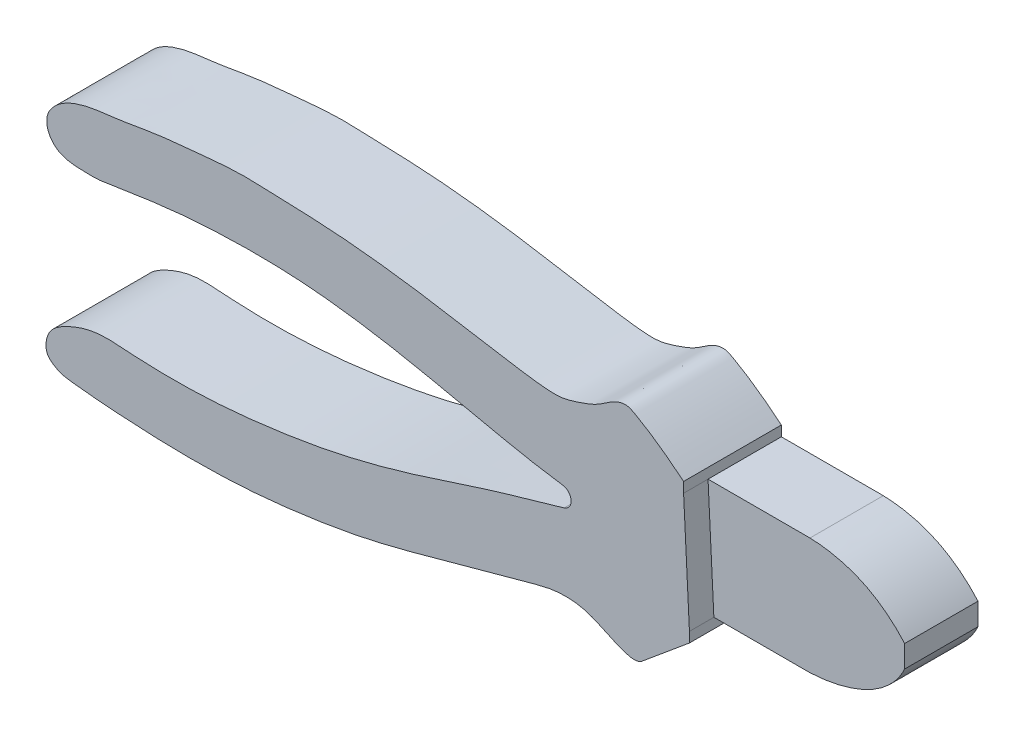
ISO-10303-21;
HEADER;
FILE_DESCRIPTION(('STEP AP214'),'2;1');
FILE_NAME('part.step','',(''),(''),'','','');
FILE_SCHEMA(('AUTOMOTIVE_DESIGN { 1 0 10303 214 1 1 1 1 }'));
ENDSEC;
DATA;
#1=APPLICATION_CONTEXT('core data for automotive mechanical design processes');
#2=APPLICATION_PROTOCOL_DEFINITION('international standard','automotive_design',2000,#1);
#3=PRODUCT_CONTEXT('',#1,'mechanical');
#4=PRODUCT('Part','Part','',(#3));
#5=PRODUCT_RELATED_PRODUCT_CATEGORY('part','',(#4));
#6=PRODUCT_DEFINITION_FORMATION('','',#4);
#7=PRODUCT_DEFINITION_CONTEXT('part definition',#1,'design');
#8=PRODUCT_DEFINITION('design','',#6,#7);
#9=PRODUCT_DEFINITION_SHAPE('','',#8);
#10=(LENGTH_UNIT() NAMED_UNIT(*) SI_UNIT(.MILLI.,.METRE.));
#11=(NAMED_UNIT(*) PLANE_ANGLE_UNIT() SI_UNIT($,.RADIAN.));
#12=(NAMED_UNIT(*) SI_UNIT($,.STERADIAN.) SOLID_ANGLE_UNIT());
#13=UNCERTAINTY_MEASURE_WITH_UNIT(LENGTH_MEASURE(1.E-05),#10,'distance_accuracy_value','');
#14=(GEOMETRIC_REPRESENTATION_CONTEXT(3) GLOBAL_UNCERTAINTY_ASSIGNED_CONTEXT((#13)) GLOBAL_UNIT_ASSIGNED_CONTEXT((#10,
#11,#12)) REPRESENTATION_CONTEXT('',''));
#15=CARTESIAN_POINT('',(0.,0.,0.));
#16=DIRECTION('',(0.,0.,1.));
#17=DIRECTION('',(1.,0.,0.));
#18=AXIS2_PLACEMENT_3D('',#15,#16,#17);
#19=CARTESIAN_POINT('',(2.59423328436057,48.3108363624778,-10.));
#20=CARTESIAN_POINT('',(1.47646928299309,46.2620053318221,-10.));
#21=CARTESIAN_POINT('',(2.66051111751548,42.8560888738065,-10.));
#22=CARTESIAN_POINT('',(6.5858538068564,41.3022828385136,-10.));
#23=CARTESIAN_POINT('',(9.56225288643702,41.2352917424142,-10.));
#24=CARTESIAN_POINT('',(12.3760863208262,41.1368955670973,-10.));
#25=CARTESIAN_POINT('',(17.9784928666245,42.0328737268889,-10.));
#26=CARTESIAN_POINT('',(27.1865835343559,43.4763817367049,-10.));
#27=CARTESIAN_POINT('',(40.8679135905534,44.3804355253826,-10.));
#28=CARTESIAN_POINT('',(56.9925215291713,44.0656132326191,-10.));
#29=CARTESIAN_POINT('',(75.780755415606,41.245410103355,-10.));
#30=CARTESIAN_POINT('',(92.9534435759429,37.1633292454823,-10.));
#31=CARTESIAN_POINT('',(103.971043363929,35.0986701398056,-10.));
#32=CARTESIAN_POINT('',(107.630187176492,34.6050114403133,-10.));
#33=B_SPLINE_CURVE_WITH_KNOTS('',3,(#19,#20,#21,#22,#23,#24,#25,#26,#27,#28,#29,#30,#31,#32),
.UNSPECIFIED.,.F.,.F.,(4,1,1,1,1,1,1,1,1,1,1,4),(0.173029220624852,0.220476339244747,
0.237410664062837,0.264634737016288,0.286507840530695,0.300105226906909,0.391007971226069,
0.494697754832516,0.605638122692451,0.750424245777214,0.917570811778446,1.),.UNSPECIFIED.);
#34=DIRECTION('',(0.,0.,1.));
#35=VECTOR('',#34,1.);
#36=SURFACE_OF_LINEAR_EXTRUSION('',#33,#35);
#37=DIRECTION('',(0.,0.,1.));
#38=VECTOR('',#37,1.);
#39=CARTESIAN_POINT('',(107.630187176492,34.6050114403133,-10.));
#40=LINE('',#39,#38);
#41=CARTESIAN_POINT('',(107.630187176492,34.6050114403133,-10.));
#42=VERTEX_POINT('',#41);
#43=CARTESIAN_POINT('',(107.630187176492,34.6050114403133,10.));
#44=VERTEX_POINT('',#43);
#45=EDGE_CURVE('E191',#42,#44,#40,.T.);
#46=ORIENTED_EDGE('',*,*,#45,.T.);
#47=CARTESIAN_POINT('',(2.59423328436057,48.3108363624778,10.));
#48=CARTESIAN_POINT('',(1.47646928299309,46.2620053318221,10.));
#49=CARTESIAN_POINT('',(2.66051111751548,42.8560888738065,10.));
#50=CARTESIAN_POINT('',(6.5858538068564,41.3022828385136,10.));
#51=CARTESIAN_POINT('',(9.56225288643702,41.2352917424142,10.));
#52=CARTESIAN_POINT('',(12.3760863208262,41.1368955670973,10.));
#53=CARTESIAN_POINT('',(17.9784928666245,42.0328737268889,10.));
#54=CARTESIAN_POINT('',(27.1865835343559,43.4763817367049,10.));
#55=CARTESIAN_POINT('',(40.8679135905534,44.3804355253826,10.));
#56=CARTESIAN_POINT('',(56.9925215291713,44.0656132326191,10.));
#57=CARTESIAN_POINT('',(75.780755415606,41.245410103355,10.));
#58=CARTESIAN_POINT('',(92.9534435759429,37.1633292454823,10.));
#59=CARTESIAN_POINT('',(103.971043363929,35.0986701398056,10.));
#60=CARTESIAN_POINT('',(107.630187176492,34.6050114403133,10.));
#61=B_SPLINE_CURVE_WITH_KNOTS('',3,(#47,#48,#49,#50,#51,#52,#53,#54,#55,#56,#57,#58,#59,#60),
.UNSPECIFIED.,.F.,.F.,(4,1,1,1,1,1,1,1,1,1,1,4),(0.173029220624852,0.220476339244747,
0.237410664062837,0.264634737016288,0.286507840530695,0.300105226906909,0.391007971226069,
0.494697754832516,0.605638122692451,0.750424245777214,0.917570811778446,1.),.UNSPECIFIED.);
#62=CARTESIAN_POINT('',(2.59423328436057,48.3108363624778,10.));
#63=VERTEX_POINT('',#62);
#64=EDGE_CURVE('E253',#63,#44,#61,.T.);
#65=ORIENTED_EDGE('',*,*,#64,.F.);
#66=DIRECTION('',(0.,0.,1.));
#67=VECTOR('',#66,1.);
#68=CARTESIAN_POINT('',(2.59423328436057,48.3108363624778,-10.));
#69=LINE('',#68,#67);
#70=CARTESIAN_POINT('',(2.59423328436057,48.3108363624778,-10.));
#71=VERTEX_POINT('',#70);
#72=EDGE_CURVE('E11',#71,#63,#69,.T.);
#73=ORIENTED_EDGE('',*,*,#72,.F.);
#74=EDGE_CURVE('E294',#71,#42,#33,.T.);
#75=ORIENTED_EDGE('',*,*,#74,.T.);
#76=EDGE_LOOP('',(#46,#65,#73,#75));
#77=FACE_BOUND('',#76,.T.);
#78=ADVANCED_FACE('F39',(#77),#36,.T.);
#79=CARTESIAN_POINT('',(132.369670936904,47.6205061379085,-10.));
#80=CARTESIAN_POINT('',(128.995611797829,50.3860055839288,-10.));
#81=CARTESIAN_POINT('',(125.642014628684,52.8778427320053,-10.));
#82=CARTESIAN_POINT('',(120.976889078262,55.3938767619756,-10.));
#83=CARTESIAN_POINT('',(119.218269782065,55.1580822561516,-10.));
#84=CARTESIAN_POINT('',(117.137784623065,54.1487715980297,-10.));
#85=CARTESIAN_POINT('',(114.725193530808,52.2265677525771,-10.));
#86=CARTESIAN_POINT('',(111.076725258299,50.9475573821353,-10.));
#87=CARTESIAN_POINT('',(107.483571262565,49.7932053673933,-10.));
#88=CARTESIAN_POINT('',(103.17865934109,50.021589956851,-10.));
#89=CARTESIAN_POINT('',(97.354781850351,50.8871071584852,-10.));
#90=CARTESIAN_POINT('',(88.8389636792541,52.2998702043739,-10.));
#91=CARTESIAN_POINT('',(79.0048645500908,54.0071144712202,-10.));
#92=CARTESIAN_POINT('',(67.9767815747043,55.4653615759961,-10.));
#93=CARTESIAN_POINT('',(57.9908738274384,56.3120323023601,-10.));
#94=CARTESIAN_POINT('',(49.2714015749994,56.4996536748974,-10.));
#95=CARTESIAN_POINT('',(40.7839541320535,56.9741615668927,-10.));
#96=CARTESIAN_POINT('',(32.6858319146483,56.0256149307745,-10.));
#97=CARTESIAN_POINT('',(24.1318491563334,55.272111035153,-10.));
#98=CARTESIAN_POINT('',(16.6381859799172,53.7468103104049,-10.));
#99=CARTESIAN_POINT('',(8.81025843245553,53.2542794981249,-10.));
#100=CARTESIAN_POINT('',(3.872862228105,50.4982255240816,-10.));
#101=CARTESIAN_POINT('',(2.59423328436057,48.3108363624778,-10.));
#102=B_SPLINE_CURVE_WITH_KNOTS('',3,(#79,#80,#81,#82,#83,#84,#85,#86,#87,#88,#89,#90,#91,#92,
#93,#94,#95,#96,#97,#98,#99,#100,#101),.UNSPECIFIED.,.F.,.F.,(4,1,1,1,1,1,1,1,1,1,1,1,1,1,1,1,1,
1,1,1,4),(0.,0.0894459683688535,0.101433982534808,0.114075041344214,0.126744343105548,
0.152595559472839,0.181536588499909,0.21179973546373,0.23523853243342,0.275985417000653,
0.34251625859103,0.426256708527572,0.497072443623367,0.588829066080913,0.647993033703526,
0.690272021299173,0.776828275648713,0.827938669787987,0.880355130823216,0.946145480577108,1.),.UNSPECIFIED.);
#103=DIRECTION('',(0.,0.,1.));
#104=VECTOR('',#103,1.);
#105=SURFACE_OF_LINEAR_EXTRUSION('',#102,#104);
#106=ORIENTED_EDGE('',*,*,#72,.T.);
#107=CARTESIAN_POINT('',(132.369670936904,47.6205061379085,10.));
#108=CARTESIAN_POINT('',(128.995611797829,50.3860055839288,10.));
#109=CARTESIAN_POINT('',(125.642014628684,52.8778427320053,10.));
#110=CARTESIAN_POINT('',(120.976889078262,55.3938767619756,10.));
#111=CARTESIAN_POINT('',(119.218269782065,55.1580822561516,10.));
#112=CARTESIAN_POINT('',(117.137784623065,54.1487715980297,10.));
#113=CARTESIAN_POINT('',(114.725193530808,52.2265677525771,10.));
#114=CARTESIAN_POINT('',(111.076725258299,50.9475573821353,10.));
#115=CARTESIAN_POINT('',(107.483571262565,49.7932053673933,10.));
#116=CARTESIAN_POINT('',(103.17865934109,50.021589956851,10.));
#117=CARTESIAN_POINT('',(97.354781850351,50.8871071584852,10.));
#118=CARTESIAN_POINT('',(88.8389636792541,52.2998702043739,10.));
#119=CARTESIAN_POINT('',(79.0048645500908,54.0071144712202,10.));
#120=CARTESIAN_POINT('',(67.9767815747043,55.4653615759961,10.));
#121=CARTESIAN_POINT('',(57.9908738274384,56.3120323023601,10.));
#122=CARTESIAN_POINT('',(49.2714015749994,56.4996536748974,10.));
#123=CARTESIAN_POINT('',(40.7839541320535,56.9741615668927,10.));
#124=CARTESIAN_POINT('',(32.6858319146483,56.0256149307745,10.));
#125=CARTESIAN_POINT('',(24.1318491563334,55.272111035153,10.));
#126=CARTESIAN_POINT('',(16.6381859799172,53.7468103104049,10.));
#127=CARTESIAN_POINT('',(8.81025843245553,53.2542794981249,10.));
#128=CARTESIAN_POINT('',(3.872862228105,50.4982255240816,10.));
#129=CARTESIAN_POINT('',(2.59423328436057,48.3108363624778,10.));
#130=B_SPLINE_CURVE_WITH_KNOTS('',3,(#107,#108,#109,#110,#111,#112,#113,#114,#115,#116,#117,
#118,#119,#120,#121,#122,#123,#124,#125,#126,#127,#128,#129),.UNSPECIFIED.,.F.,.F.,(4,1,1,1,1,1,
1,1,1,1,1,1,1,1,1,1,1,1,1,1,4),(0.,0.0894459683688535,0.101433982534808,0.114075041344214,
0.126744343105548,0.152595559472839,0.181536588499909,0.21179973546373,0.23523853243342,
0.275985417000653,0.34251625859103,0.426256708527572,0.497072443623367,0.588829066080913,
0.647993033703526,0.690272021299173,0.776828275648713,0.827938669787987,0.880355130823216,
0.946145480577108,1.),.UNSPECIFIED.);
#131=CARTESIAN_POINT('',(132.369670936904,47.6205061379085,10.));
#132=VERTEX_POINT('',#131);
#133=EDGE_CURVE('E289',#132,#63,#130,.T.);
#134=ORIENTED_EDGE('',*,*,#133,.F.);
#135=DIRECTION('',(0.,0.,1.));
#136=VECTOR('',#135,1.);
#137=CARTESIAN_POINT('',(132.369670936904,47.6205061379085,-10.));
#138=LINE('',#137,#136);
#139=CARTESIAN_POINT('',(132.369670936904,47.6205061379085,-10.));
#140=VERTEX_POINT('',#139);
#141=EDGE_CURVE('E49',#140,#132,#138,.T.);
#142=ORIENTED_EDGE('',*,*,#141,.F.);
#143=EDGE_CURVE('E193',#140,#71,#102,.T.);
#144=ORIENTED_EDGE('',*,*,#143,.T.);
#145=EDGE_LOOP('',(#106,#134,#142,#144));
#146=FACE_BOUND('',#145,.T.);
#147=ADVANCED_FACE('F340',(#146),#105,.T.);
#148=CARTESIAN_POINT('',(132.369670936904,47.6205061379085,-10.));
#149=DIRECTION('',(1.,0.,0.));
#150=DIRECTION('',(0.,0.,-1.));
#151=AXIS2_PLACEMENT_3D('',#148,#149,#150);
#152=PLANE('',#151);
#153=ORIENTED_EDGE('',*,*,#141,.T.);
#154=DIRECTION('',(0.,1.,0.));
#155=VECTOR('',#154,1.);
#156=CARTESIAN_POINT('',(132.369670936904,47.6205061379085,10.));
#157=LINE('',#156,#155);
#158=CARTESIAN_POINT('',(132.369670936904,45.5254586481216,10.));
#159=VERTEX_POINT('',#158);
#160=EDGE_CURVE('E285',#159,#132,#157,.T.);
#161=ORIENTED_EDGE('',*,*,#160,.F.);
#162=DIRECTION('',(0.,0.,1.));
#163=VECTOR('',#162,1.);
#164=CARTESIAN_POINT('',(132.369670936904,45.5254586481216,5.));
#165=LINE('',#164,#163);
#166=CARTESIAN_POINT('',(132.369670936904,45.5254586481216,5.));
#167=VERTEX_POINT('',#166);
#168=EDGE_CURVE('E147',#167,#159,#165,.T.);
#169=ORIENTED_EDGE('',*,*,#168,.F.);
#170=DIRECTION('',(0.,0.,1.));
#171=VECTOR('',#170,1.);
#172=CARTESIAN_POINT('',(132.369670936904,45.5254586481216,-10.));
#173=LINE('',#172,#171);
#174=CARTESIAN_POINT('',(132.369670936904,45.5254586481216,-10.));
#175=VERTEX_POINT('',#174);
#176=EDGE_CURVE('E206',#175,#167,#173,.T.);
#177=ORIENTED_EDGE('',*,*,#176,.F.);
#178=DIRECTION('',(0.,1.,0.));
#179=VECTOR('',#178,1.);
#180=CARTESIAN_POINT('',(132.369670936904,47.6205061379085,-10.));
#181=LINE('',#180,#179);
#182=EDGE_CURVE('E354',#175,#140,#181,.T.);
#183=ORIENTED_EDGE('',*,*,#182,.T.);
#184=EDGE_LOOP('',(#153,#161,#169,#177,#183));
#185=FACE_BOUND('',#184,.T.);
#186=ADVANCED_FACE('F344',(#185),#152,.T.);
#187=CARTESIAN_POINT('',(132.369670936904,45.5254586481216,-10.));
#188=DIRECTION('',(0.,1.,0.));
#189=DIRECTION('',(0.,0.,1.));
#190=AXIS2_PLACEMENT_3D('',#187,#188,#189);
#191=PLANE('',#190);
#192=DIRECTION('',(-1.,0.,0.));
#193=VECTOR('',#192,1.);
#194=CARTESIAN_POINT('',(153.224210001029,45.5254586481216,5.));
#195=LINE('',#194,#193);
#196=CARTESIAN_POINT('',(153.224210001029,45.5254586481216,5.));
#197=VERTEX_POINT('',#196);
#198=EDGE_CURVE('E148',#197,#167,#195,.T.);
#199=ORIENTED_EDGE('',*,*,#198,.F.);
#200=DIRECTION('',(0.,0.,1.));
#201=VECTOR('',#200,1.);
#202=CARTESIAN_POINT('',(153.224210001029,45.5254586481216,-10.));
#203=LINE('',#202,#201);
#204=CARTESIAN_POINT('',(153.224210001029,45.5254586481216,-10.));
#205=VERTEX_POINT('',#204);
#206=EDGE_CURVE('E208',#205,#197,#203,.T.);
#207=ORIENTED_EDGE('',*,*,#206,.F.);
#208=DIRECTION('',(-1.,0.,0.));
#209=VECTOR('',#208,1.);
#210=CARTESIAN_POINT('',(132.369670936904,45.5254586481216,-10.));
#211=LINE('',#210,#209);
#212=EDGE_CURVE('E357',#205,#175,#211,.T.);
#213=ORIENTED_EDGE('',*,*,#212,.T.);
#214=ORIENTED_EDGE('',*,*,#176,.T.);
#215=EDGE_LOOP('',(#199,#207,#213,#214));
#216=FACE_BOUND('',#215,.T.);
#217=ADVANCED_FACE('F369',(#216),#191,.T.);
#218=CARTESIAN_POINT('',(172.594233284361,36.5190740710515,-10.));
#219=CARTESIAN_POINT('',(169.994484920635,39.484398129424,-10.));
#220=CARTESIAN_POINT('',(163.940446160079,44.00379898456,-10.));
#221=CARTESIAN_POINT('',(156.586018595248,45.414954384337,-10.));
#222=CARTESIAN_POINT('',(153.224210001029,45.5254586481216,-10.));
#223=B_SPLINE_CURVE_WITH_KNOTS('',3,(#218,#219,#220,#221,#222),.UNSPECIFIED.,.F.,.F.,(4,1,4),
(0.,0.539271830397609,1.),.UNSPECIFIED.);
#224=DIRECTION('',(0.,0.,1.));
#225=VECTOR('',#224,1.);
#226=SURFACE_OF_LINEAR_EXTRUSION('',#223,#225);
#227=CARTESIAN_POINT('',(172.594233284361,36.5190740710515,5.));
#228=CARTESIAN_POINT('',(172.280765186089,36.8766056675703,5.));
#229=CARTESIAN_POINT('',(171.958018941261,37.2260466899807,5.));
#230=CARTESIAN_POINT('',(171.294998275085,37.9075699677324,5.));
#231=CARTESIAN_POINT('',(170.954731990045,38.2396601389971,5.));
#232=CARTESIAN_POINT('',(170.373387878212,38.7781965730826,5.));
#233=CARTESIAN_POINT('',(170.136966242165,38.9896914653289,5.));
#234=CARTESIAN_POINT('',(169.656830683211,39.4043047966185,5.));
#235=CARTESIAN_POINT('',(169.413115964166,39.6074223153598,5.));
#236=CARTESIAN_POINT('',(168.918608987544,40.0049680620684,5.));
#237=CARTESIAN_POINT('',(168.667814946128,40.1993940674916,5.));
#238=CARTESIAN_POINT('',(168.031698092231,40.6745912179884,5.));
#239=CARTESIAN_POINT('',(167.642092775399,40.9496652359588,5.));
#240=CARTESIAN_POINT('',(166.848354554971,41.4781154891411,5.));
#241=CARTESIAN_POINT('',(166.444219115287,41.7314879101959,5.));
#242=CARTESIAN_POINT('',(165.62235979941,42.2151895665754,5.));
#243=CARTESIAN_POINT('',(165.204636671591,42.4455200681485,5.));
#244=CARTESIAN_POINT('',(164.568495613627,42.7727619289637,5.));
#245=CARTESIAN_POINT('',(164.354752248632,42.8788461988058,5.));
#246=CARTESIAN_POINT('',(163.924252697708,43.0847278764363,5.));
#247=CARTESIAN_POINT('',(163.707496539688,43.1845253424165,5.));
#248=CARTESIAN_POINT('',(163.271117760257,43.3776290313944,5.));
#249=CARTESIAN_POINT('',(163.051495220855,43.4709354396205,5.));
#250=CARTESIAN_POINT('',(162.609577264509,43.6509695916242,5.));
#251=CARTESIAN_POINT('',(162.387281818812,43.7376972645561,5.));
#252=CARTESIAN_POINT('',(161.716825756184,43.9881350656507,5.));
#253=CARTESIAN_POINT('',(161.26499302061,44.1421451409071,5.));
#254=CARTESIAN_POINT('',(160.502427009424,44.3787013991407,5.));
#255=CARTESIAN_POINT('',(160.193801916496,44.4681606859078,5.));
#256=CARTESIAN_POINT('',(159.573515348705,44.635853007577,5.));
#257=CARTESIAN_POINT('',(159.261853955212,44.7140863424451,5.));
#258=CARTESIAN_POINT('',(158.635948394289,44.8595593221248,5.));
#259=CARTESIAN_POINT('',(158.321703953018,44.9267977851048,5.));
#260=CARTESIAN_POINT('',(157.691061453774,45.0505088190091,5.));
#261=CARTESIAN_POINT('',(157.374663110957,45.1069799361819,5.));
#262=CARTESIAN_POINT('',(156.740263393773,45.2093500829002,5.));
#263=CARTESIAN_POINT('',(156.422262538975,45.255252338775,5.));
#264=CARTESIAN_POINT('',(155.784975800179,45.3367118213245,5.));
#265=CARTESIAN_POINT('',(155.46569005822,45.3722701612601,5.));
#266=CARTESIAN_POINT('',(154.826271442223,45.4332326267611,5.));
#267=CARTESIAN_POINT('',(154.506138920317,45.4586404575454,5.));
#268=CARTESIAN_POINT('',(153.865458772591,45.4994772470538,5.));
#269=CARTESIAN_POINT('',(153.544911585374,45.5149130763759,5.));
#270=CARTESIAN_POINT('',(153.224210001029,45.5254586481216,5.));
#271=B_SPLINE_CURVE_WITH_KNOTS('',3,(#227,#228,#229,#230,#231,#232,#233,#234,#235,#236,#237,
#238,#239,#240,#241,#242,#243,#244,#245,#246,#247,#248,#249,#250,#251,#252,#253,#254,#255,#256,
#257,#258,#259,#260,#261,#262,#263,#264,#265,#266,#267,#268,#269,#270),.UNSPECIFIED.,.F.,.F.,(4,
2,2,2,2,2,2,2,2,2,2,2,2,2,2,2,2,2,2,2,2,4),(0.,1.42637660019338,2.8520966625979,3.8035653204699,
4.75513822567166,5.70695308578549,7.13698314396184,8.56726402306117,9.9974662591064,
10.7132464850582,11.4290200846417,12.1447732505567,12.8605341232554,14.2917206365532,
15.2555246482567,16.2193029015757,17.1831846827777,18.1471965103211,19.1109136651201,
20.074527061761,21.0377883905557,22.0003853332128),.UNSPECIFIED.);
#272=CARTESIAN_POINT('',(172.594233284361,36.5190740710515,5.));
#273=VERTEX_POINT('',#272);
#274=EDGE_CURVE('E238',#273,#197,#271,.T.);
#275=ORIENTED_EDGE('',*,*,#274,.F.);
#276=DIRECTION('',(0.,0.,1.));
#277=VECTOR('',#276,1.);
#278=CARTESIAN_POINT('',(172.594233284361,36.5190740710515,-10.));
#279=LINE('',#278,#277);
#280=CARTESIAN_POINT('',(172.594233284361,36.5190740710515,-10.));
#281=VERTEX_POINT('',#280);
#282=EDGE_CURVE('E198',#281,#273,#279,.T.);
#283=ORIENTED_EDGE('',*,*,#282,.F.);
#284=EDGE_CURVE('E381',#281,#205,#223,.T.);
#285=ORIENTED_EDGE('',*,*,#284,.T.);
#286=ORIENTED_EDGE('',*,*,#206,.T.);
#287=EDGE_LOOP('',(#275,#283,#285,#286));
#288=FACE_BOUND('',#287,.T.);
#289=ADVANCED_FACE('F373',(#288),#226,.T.);
#290=CARTESIAN_POINT('',(172.594233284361,36.5190740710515,-10.));
#291=DIRECTION('',(1.,0.,0.));
#292=DIRECTION('',(0.,0.,-1.));
#293=AXIS2_PLACEMENT_3D('',#290,#291,#292);
#294=PLANE('',#293);
#295=DIRECTION('',(0.,1.,0.));
#296=VECTOR('',#295,1.);
#297=CARTESIAN_POINT('',(172.594233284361,31.9959008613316,5.));
#298=LINE('',#297,#296);
#299=CARTESIAN_POINT('',(172.594233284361,31.9959008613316,5.));
#300=VERTEX_POINT('',#299);
#301=EDGE_CURVE('E214',#300,#273,#298,.T.);
#302=ORIENTED_EDGE('',*,*,#301,.F.);
#303=DIRECTION('',(0.,0.,1.));
#304=VECTOR('',#303,1.);
#305=CARTESIAN_POINT('',(172.594233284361,31.9959008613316,-10.));
#306=LINE('',#305,#304);
#307=CARTESIAN_POINT('',(172.594233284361,31.9959008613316,-10.));
#308=VERTEX_POINT('',#307);
#309=EDGE_CURVE('E178',#308,#300,#306,.T.);
#310=ORIENTED_EDGE('',*,*,#309,.F.);
#311=DIRECTION('',(0.,1.,0.));
#312=VECTOR('',#311,1.);
#313=CARTESIAN_POINT('',(172.594233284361,36.5190740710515,-10.));
#314=LINE('',#313,#312);
#315=EDGE_CURVE('E388',#308,#281,#314,.T.);
#316=ORIENTED_EDGE('',*,*,#315,.T.);
#317=ORIENTED_EDGE('',*,*,#282,.T.);
#318=EDGE_LOOP('',(#302,#310,#316,#317));
#319=FACE_BOUND('',#318,.T.);
#320=ADVANCED_FACE('F378',(#319),#294,.T.);
#321=CARTESIAN_POINT('',(153.224210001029,21.6555071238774,-10.));
#322=CARTESIAN_POINT('',(160.559462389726,21.9856602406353,-10.));
#323=CARTESIAN_POINT('',(169.262082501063,24.8381039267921,-10.));
#324=CARTESIAN_POINT('',(172.594233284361,31.9959008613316,-10.));
#325=B_SPLINE_CURVE_WITH_KNOTS('',3,(#321,#322,#323,#324),.UNSPECIFIED.,.F.,.F.,(4,4),(0.,1.),.UNSPECIFIED.);
#326=DIRECTION('',(0.,0.,1.));
#327=VECTOR('',#326,1.);
#328=SURFACE_OF_LINEAR_EXTRUSION('',#325,#327);
#329=CARTESIAN_POINT('',(153.224210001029,21.6555071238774,5.));
#330=CARTESIAN_POINT('',(153.541478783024,21.6698024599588,5.));
#331=CARTESIAN_POINT('',(153.858541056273,21.6886614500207,5.));
#332=CARTESIAN_POINT('',(154.491980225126,21.7354660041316,5.));
#333=CARTESIAN_POINT('',(154.808357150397,21.7634111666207,5.));
#334=CARTESIAN_POINT('',(155.440169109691,21.8283473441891,5.));
#335=CARTESIAN_POINT('',(155.755604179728,21.8653380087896,5.));
#336=CARTESIAN_POINT('',(156.389089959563,21.9489255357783,5.));
#337=CARTESIAN_POINT('',(156.707126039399,21.9956333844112,5.));
#338=CARTESIAN_POINT('',(157.341690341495,22.098497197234,5.));
#339=CARTESIAN_POINT('',(157.658218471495,22.1546537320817,5.));
#340=CARTESIAN_POINT('',(158.289466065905,22.2766069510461,5.));
#341=CARTESIAN_POINT('',(158.604185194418,22.342405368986,5.));
#342=CARTESIAN_POINT('',(159.40867759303,22.523857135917,5.));
#343=CARTESIAN_POINT('',(159.896860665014,22.646670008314,5.));
#344=CARTESIAN_POINT('',(160.86625610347,22.9176800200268,5.));
#345=CARTESIAN_POINT('',(161.347466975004,23.0658825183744,5.));
#346=CARTESIAN_POINT('',(162.301043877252,23.3891929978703,5.));
#347=CARTESIAN_POINT('',(162.773405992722,23.5643125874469,5.));
#348=CARTESIAN_POINT('',(163.704397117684,23.9422070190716,5.));
#349=CARTESIAN_POINT('',(164.163080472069,24.1448472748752,5.));
#350=CARTESIAN_POINT('',(165.065846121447,24.5801202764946,5.));
#351=CARTESIAN_POINT('',(165.509933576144,24.8127422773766,5.));
#352=CARTESIAN_POINT('',(166.379695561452,25.3096593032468,5.));
#353=CARTESIAN_POINT('',(166.805385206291,25.5739276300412,5.));
#354=CARTESIAN_POINT('',(167.457806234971,26.0161623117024,5.));
#355=CARTESIAN_POINT('',(167.692126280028,26.1830069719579,5.));
#356=CARTESIAN_POINT('',(168.15237367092,26.5278807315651,5.));
#357=CARTESIAN_POINT('',(168.378302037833,26.7059084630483,5.));
#358=CARTESIAN_POINT('',(168.820785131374,27.0732950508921,5.));
#359=CARTESIAN_POINT('',(169.037339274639,27.2626546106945,5.));
#360=CARTESIAN_POINT('',(169.459497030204,27.6522446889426,5.));
#361=CARTESIAN_POINT('',(169.665125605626,27.8524481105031,5.));
#362=CARTESIAN_POINT('',(170.064902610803,28.2640063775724,5.));
#363=CARTESIAN_POINT('',(170.259051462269,28.4753608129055,5.));
#364=CARTESIAN_POINT('',(170.634746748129,28.9088719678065,5.));
#365=CARTESIAN_POINT('',(170.816297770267,29.131024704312,5.));
#366=CARTESIAN_POINT('',(171.147949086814,29.5624410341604,5.));
#367=CARTESIAN_POINT('',(171.299365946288,29.7706933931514,5.));
#368=CARTESIAN_POINT('',(171.590608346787,30.195093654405,5.));
#369=CARTESIAN_POINT('',(171.73043638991,30.4112398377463,5.));
#370=CARTESIAN_POINT('',(171.998337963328,30.8515366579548,5.));
#371=CARTESIAN_POINT('',(172.12637719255,31.075708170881,5.));
#372=CARTESIAN_POINT('',(172.369867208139,31.5308714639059,5.));
#373=CARTESIAN_POINT('',(172.485314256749,31.7618652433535,5.));
#374=CARTESIAN_POINT('',(172.594233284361,31.9959008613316,5.));
#375=B_SPLINE_CURVE_WITH_KNOTS('',3,(#329,#330,#331,#332,#333,#334,#335,#336,#337,#338,#339,
#340,#341,#342,#343,#344,#345,#346,#347,#348,#349,#350,#351,#352,#353,#354,#355,#356,#357,#358,
#359,#360,#361,#362,#363,#364,#365,#366,#367,#368,#369,#370,#371,#372,#373,#374),.UNSPECIFIED.,
.F.,.F.,(4,2,2,2,2,2,2,2,2,2,2,2,2,2,2,2,2,2,2,2,2,2,4),(0.,0.952737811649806,1.90543352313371,
2.85809232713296,3.82229657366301,4.78655907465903,5.75099518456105,7.26049560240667,
8.77031502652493,10.2807874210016,11.7841225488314,13.2869203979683,14.7884592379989,
15.6511221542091,16.5136797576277,17.3762909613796,18.2368380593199,19.0973535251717,
19.9575539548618,20.7296265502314,21.5015320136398,22.2756167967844,23.049930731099),.UNSPECIFIED.);
#376=CARTESIAN_POINT('',(153.224210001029,21.6555071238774,5.));
#377=VERTEX_POINT('',#376);
#378=EDGE_CURVE('E167',#377,#300,#375,.T.);
#379=ORIENTED_EDGE('',*,*,#378,.F.);
#380=DIRECTION('',(0.,0.,1.));
#381=VECTOR('',#380,1.);
#382=CARTESIAN_POINT('',(153.224210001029,21.6555071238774,-10.));
#383=LINE('',#382,#381);
#384=CARTESIAN_POINT('',(153.224210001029,21.6555071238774,-10.));
#385=VERTEX_POINT('',#384);
#386=EDGE_CURVE('E165',#385,#377,#383,.T.);
#387=ORIENTED_EDGE('',*,*,#386,.F.);
#388=EDGE_CURVE('E418',#385,#308,#325,.T.);
#389=ORIENTED_EDGE('',*,*,#388,.T.);
#390=ORIENTED_EDGE('',*,*,#309,.T.);
#391=EDGE_LOOP('',(#379,#387,#389,#390));
#392=FACE_BOUND('',#391,.T.);
#393=ADVANCED_FACE('F416',(#392),#328,.T.);
#394=CARTESIAN_POINT('',(133.563656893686,21.6555071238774,-10.));
#395=DIRECTION('',(0.,-1.,0.));
#396=DIRECTION('',(0.,0.,-1.));
#397=AXIS2_PLACEMENT_3D('',#394,#395,#396);
#398=PLANE('',#397);
#399=DIRECTION('',(1.,0.,0.));
#400=VECTOR('',#399,1.);
#401=CARTESIAN_POINT('',(133.563656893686,21.6555071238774,5.));
#402=LINE('',#401,#400);
#403=CARTESIAN_POINT('',(133.563656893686,21.6555071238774,5.));
#404=VERTEX_POINT('',#403);
#405=EDGE_CURVE('E153',#404,#377,#402,.T.);
#406=ORIENTED_EDGE('',*,*,#405,.F.);
#407=DIRECTION('',(0.,0.,1.));
#408=VECTOR('',#407,1.);
#409=CARTESIAN_POINT('',(133.563656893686,21.6555071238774,-10.));
#410=LINE('',#409,#408);
#411=CARTESIAN_POINT('',(133.563656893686,21.6555071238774,-10.));
#412=VERTEX_POINT('',#411);
#413=EDGE_CURVE('E163',#412,#404,#410,.T.);
#414=ORIENTED_EDGE('',*,*,#413,.F.);
#415=DIRECTION('',(1.,0.,0.));
#416=VECTOR('',#415,1.);
#417=CARTESIAN_POINT('',(133.563656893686,21.6555071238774,-10.));
#418=LINE('',#417,#416);
#419=EDGE_CURVE('E420',#412,#385,#418,.T.);
#420=ORIENTED_EDGE('',*,*,#419,.T.);
#421=ORIENTED_EDGE('',*,*,#386,.T.);
#422=EDGE_LOOP('',(#406,#414,#420,#421));
#423=FACE_BOUND('',#422,.T.);
#424=ADVANCED_FACE('F161',(#423),#398,.T.);
#425=CARTESIAN_POINT('',(133.563656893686,19.5889067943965,-10.));
#426=DIRECTION('',(1.,0.,0.));
#427=DIRECTION('',(0.,0.,-1.));
#428=AXIS2_PLACEMENT_3D('',#425,#426,#427);
#429=PLANE('',#428);
#430=ORIENTED_EDGE('',*,*,#413,.T.);
#431=DIRECTION('',(0.,0.,1.));
#432=VECTOR('',#431,1.);
#433=CARTESIAN_POINT('',(133.563656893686,21.6555071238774,5.));
#434=LINE('',#433,#432);
#435=CARTESIAN_POINT('',(133.563656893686,21.6555071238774,10.));
#436=VERTEX_POINT('',#435);
#437=EDGE_CURVE('E135',#404,#436,#434,.T.);
#438=ORIENTED_EDGE('',*,*,#437,.T.);
#439=DIRECTION('',(0.,1.,0.));
#440=VECTOR('',#439,1.);
#441=CARTESIAN_POINT('',(133.563656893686,19.5889067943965,10.));
#442=LINE('',#441,#440);
#443=CARTESIAN_POINT('',(133.563656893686,19.5889067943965,10.));
#444=VERTEX_POINT('',#443);
#445=EDGE_CURVE('E282',#444,#436,#442,.T.);
#446=ORIENTED_EDGE('',*,*,#445,.F.);
#447=DIRECTION('',(0.,0.,1.));
#448=VECTOR('',#447,1.);
#449=CARTESIAN_POINT('',(133.563656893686,19.5889067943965,-10.));
#450=LINE('',#449,#448);
#451=CARTESIAN_POINT('',(133.563656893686,19.5889067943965,-10.));
#452=VERTEX_POINT('',#451);
#453=EDGE_CURVE('E174',#452,#444,#450,.T.);
#454=ORIENTED_EDGE('',*,*,#453,.F.);
#455=DIRECTION('',(0.,1.,0.));
#456=VECTOR('',#455,1.);
#457=CARTESIAN_POINT('',(133.563656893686,19.5889067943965,-10.));
#458=LINE('',#457,#456);
#459=EDGE_CURVE('E172',#452,#412,#458,.T.);
#460=ORIENTED_EDGE('',*,*,#459,.T.);
#461=EDGE_LOOP('',(#430,#438,#446,#454,#460));
#462=FACE_BOUND('',#461,.T.);
#463=ADVANCED_FACE('F170',(#462),#429,.T.);
#464=CARTESIAN_POINT('',(123.607353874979,11.3047814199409,-10.));
#465=DIRECTION('',(0.639601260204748,-0.768706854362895,0.));
#466=DIRECTION('',(0.768706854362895,0.639601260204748,0.));
#467=AXIS2_PLACEMENT_3D('',#464,#465,#466);
#468=PLANE('',#467);
#469=ORIENTED_EDGE('',*,*,#453,.T.);
#470=DIRECTION('',(0.768706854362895,0.639601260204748,0.));
#471=VECTOR('',#470,1.);
#472=CARTESIAN_POINT('',(123.607353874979,11.3047814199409,10.));
#473=LINE('',#472,#471);
#474=CARTESIAN_POINT('',(123.607353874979,11.3047814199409,10.));
#475=VERTEX_POINT('',#474);
#476=EDGE_CURVE('E275',#475,#444,#473,.T.);
#477=ORIENTED_EDGE('',*,*,#476,.F.);
#478=DIRECTION('',(0.,0.,1.));
#479=VECTOR('',#478,1.);
#480=CARTESIAN_POINT('',(123.607353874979,11.3047814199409,-10.));
#481=LINE('',#480,#479);
#482=CARTESIAN_POINT('',(123.607353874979,11.3047814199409,-10.));
#483=VERTEX_POINT('',#482);
#484=EDGE_CURVE('E180',#483,#475,#481,.T.);
#485=ORIENTED_EDGE('',*,*,#484,.F.);
#486=DIRECTION('',(0.768706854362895,0.639601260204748,0.));
#487=VECTOR('',#486,1.);
#488=CARTESIAN_POINT('',(123.607353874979,11.3047814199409,-10.));
#489=LINE('',#488,#487);
#490=EDGE_CURVE('E317',#483,#452,#489,.T.);
#491=ORIENTED_EDGE('',*,*,#490,.T.);
#492=EDGE_LOOP('',(#469,#477,#485,#491));
#493=FACE_BOUND('',#492,.T.);
#494=ADVANCED_FACE('F327',(#493),#468,.T.);
#495=CARTESIAN_POINT('',(107.934661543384,30.7064707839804,-10.));
#496=CARTESIAN_POINT('',(106.614846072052,30.3126439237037,-10.));
#497=CARTESIAN_POINT('',(102.33249412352,29.0164065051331,-10.));
#498=CARTESIAN_POINT('',(93.5241837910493,26.6331616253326,-10.));
#499=CARTESIAN_POINT('',(83.1073442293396,23.0919328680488,-10.));
#500=CARTESIAN_POINT('',(71.9566823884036,19.6413617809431,-10.));
#501=CARTESIAN_POINT('',(60.7434734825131,16.845305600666,-10.));
#502=CARTESIAN_POINT('',(48.0197987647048,14.713561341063,-10.));
#503=CARTESIAN_POINT('',(33.8052042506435,13.3330383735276,-10.));
#504=CARTESIAN_POINT('',(21.9142325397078,13.4276899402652,-10.));
#505=CARTESIAN_POINT('',(13.945165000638,14.1784849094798,-10.));
#506=CARTESIAN_POINT('',(10.186760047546,13.5430314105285,-10.));
#507=CARTESIAN_POINT('',(7.75031215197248,12.720020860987,-10.));
#508=CARTESIAN_POINT('',(5.22892665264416,11.5956241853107,-10.));
#509=CARTESIAN_POINT('',(2.48706433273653,9.63088146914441,-10.));
#510=CARTESIAN_POINT('',(1.72919940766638,6.34785929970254,-10.));
#511=CARTESIAN_POINT('',(2.35794031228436,4.49783184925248,-10.));
#512=CARTESIAN_POINT('',(4.17724325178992,3.42905308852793,-10.));
#513=CARTESIAN_POINT('',(5.48045525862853,2.80577623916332,-10.));
#514=CARTESIAN_POINT('',(12.3204556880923,2.13337315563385,-10.));
#515=CARTESIAN_POINT('',(14.9616023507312,1.88914016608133,-10.));
#516=CARTESIAN_POINT('',(24.0133012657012,1.34343436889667,-10.));
#517=CARTESIAN_POINT('',(32.2601448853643,1.20727157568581,-10.));
#518=CARTESIAN_POINT('',(42.2352952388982,1.43634970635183,-10.));
#519=CARTESIAN_POINT('',(54.4408176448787,2.63863059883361,-10.));
#520=CARTESIAN_POINT('',(70.1738310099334,5.30155080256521,-10.));
#521=CARTESIAN_POINT('',(85.4863528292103,9.79711862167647,-10.));
#522=CARTESIAN_POINT('',(97.8797192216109,13.0254991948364,-10.));
#523=CARTESIAN_POINT('',(106.006044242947,15.412719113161,-10.));
#524=CARTESIAN_POINT('',(113.263001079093,15.1175733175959,-10.));
#525=CARTESIAN_POINT('',(118.406858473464,11.65485890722,-10.));
#526=CARTESIAN_POINT('',(122.56800909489,10.7780943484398,-10.));
#527=CARTESIAN_POINT('',(123.607353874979,11.3047814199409,-10.));
#528=B_SPLINE_CURVE_WITH_KNOTS('',3,(#495,#496,#497,#498,#499,#500,#501,#502,#503,#504,#505,
#506,#507,#508,#509,#510,#511,#512,#513,#514,#515,#516,#517,#518,#519,#520,#521,#522,#523,#524,
#525,#526,#527),.UNSPECIFIED.,.F.,.F.,(4,1,1,1,1,1,1,1,1,1,1,1,1,1,1,1,1,1,1,1,1,1,1,1,1,1,1,1,
1,1,4),(0.0903000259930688,0.106405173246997,0.142661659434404,0.196890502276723,
0.234993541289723,0.279088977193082,0.331864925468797,0.385692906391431,0.445737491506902,
0.470952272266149,0.478530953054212,0.490078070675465,0.501065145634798,0.510206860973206,
0.515641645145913,0.523284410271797,0.531492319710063,0.539892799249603,0.547482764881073,
0.566071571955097,0.603765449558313,0.635211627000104,0.667445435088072,0.718904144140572,
0.779069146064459,0.853448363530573,0.905280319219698,0.928886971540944,0.952276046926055,
0.987148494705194,1.),.UNSPECIFIED.);
#529=DIRECTION('',(0.,0.,1.));
#530=VECTOR('',#529,1.);
#531=SURFACE_OF_LINEAR_EXTRUSION('',#528,#530);
#532=ORIENTED_EDGE('',*,*,#484,.T.);
#533=CARTESIAN_POINT('',(107.934661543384,30.7064707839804,10.));
#534=CARTESIAN_POINT('',(106.614846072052,30.3126439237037,10.));
#535=CARTESIAN_POINT('',(102.33249412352,29.0164065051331,10.));
#536=CARTESIAN_POINT('',(93.5241837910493,26.6331616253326,10.));
#537=CARTESIAN_POINT('',(83.1073442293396,23.0919328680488,10.));
#538=CARTESIAN_POINT('',(71.9566823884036,19.6413617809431,10.));
#539=CARTESIAN_POINT('',(60.7434734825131,16.845305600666,10.));
#540=CARTESIAN_POINT('',(48.0197987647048,14.713561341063,10.));
#541=CARTESIAN_POINT('',(33.8052042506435,13.3330383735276,10.));
#542=CARTESIAN_POINT('',(21.9142325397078,13.4276899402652,10.));
#543=CARTESIAN_POINT('',(13.945165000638,14.1784849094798,10.));
#544=CARTESIAN_POINT('',(10.186760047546,13.5430314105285,10.));
#545=CARTESIAN_POINT('',(7.75031215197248,12.720020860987,10.));
#546=CARTESIAN_POINT('',(5.22892665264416,11.5956241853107,10.));
#547=CARTESIAN_POINT('',(2.48706433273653,9.63088146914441,10.));
#548=CARTESIAN_POINT('',(1.72919940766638,6.34785929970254,10.));
#549=CARTESIAN_POINT('',(2.35794031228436,4.49783184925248,10.));
#550=CARTESIAN_POINT('',(4.17724325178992,3.42905308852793,10.));
#551=CARTESIAN_POINT('',(5.48045525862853,2.80577623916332,10.));
#552=CARTESIAN_POINT('',(12.3204556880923,2.13337315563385,10.));
#553=CARTESIAN_POINT('',(14.9616023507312,1.88914016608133,10.));
#554=CARTESIAN_POINT('',(24.0133012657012,1.34343436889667,10.));
#555=CARTESIAN_POINT('',(32.2601448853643,1.20727157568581,10.));
#556=CARTESIAN_POINT('',(42.2352952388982,1.43634970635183,10.));
#557=CARTESIAN_POINT('',(54.4408176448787,2.63863059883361,10.));
#558=CARTESIAN_POINT('',(70.1738310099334,5.30155080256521,10.));
#559=CARTESIAN_POINT('',(85.4863528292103,9.79711862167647,10.));
#560=CARTESIAN_POINT('',(97.8797192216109,13.0254991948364,10.));
#561=CARTESIAN_POINT('',(106.006044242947,15.412719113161,10.));
#562=CARTESIAN_POINT('',(113.263001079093,15.1175733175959,10.));
#563=CARTESIAN_POINT('',(118.406858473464,11.65485890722,10.));
#564=CARTESIAN_POINT('',(122.56800909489,10.7780943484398,10.));
#565=CARTESIAN_POINT('',(123.607353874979,11.3047814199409,10.));
#566=B_SPLINE_CURVE_WITH_KNOTS('',3,(#533,#534,#535,#536,#537,#538,#539,#540,#541,#542,#543,
#544,#545,#546,#547,#548,#549,#550,#551,#552,#553,#554,#555,#556,#557,#558,#559,#560,#561,#562,
#563,#564,#565),.UNSPECIFIED.,.F.,.F.,(4,1,1,1,1,1,1,1,1,1,1,1,1,1,1,1,1,1,1,1,1,1,1,1,1,1,1,1,
1,1,4),(0.0903000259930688,0.106405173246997,0.142661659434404,0.196890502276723,
0.234993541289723,0.279088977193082,0.331864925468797,0.385692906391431,0.445737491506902,
0.470952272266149,0.478530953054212,0.490078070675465,0.501065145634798,0.510206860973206,
0.515641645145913,0.523284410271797,0.531492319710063,0.539892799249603,0.547482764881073,
0.566071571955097,0.603765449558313,0.635211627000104,0.667445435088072,0.718904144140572,
0.779069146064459,0.853448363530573,0.905280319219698,0.928886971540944,0.952276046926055,
0.987148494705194,1.),.UNSPECIFIED.);
#567=CARTESIAN_POINT('',(107.934661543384,30.7064707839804,10.));
#568=VERTEX_POINT('',#567);
#569=EDGE_CURVE('E269',#568,#475,#566,.T.);
#570=ORIENTED_EDGE('',*,*,#569,.F.);
#571=DIRECTION('',(0.,0.,1.));
#572=VECTOR('',#571,1.);
#573=CARTESIAN_POINT('',(107.934661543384,30.7064707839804,-10.));
#574=LINE('',#573,#572);
#575=CARTESIAN_POINT('',(107.934661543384,30.7064707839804,-10.));
#576=VERTEX_POINT('',#575);
#577=EDGE_CURVE('E188',#576,#568,#574,.T.);
#578=ORIENTED_EDGE('',*,*,#577,.F.);
#579=EDGE_CURVE('E310',#576,#483,#528,.T.);
#580=ORIENTED_EDGE('',*,*,#579,.T.);
#581=EDGE_LOOP('',(#532,#570,#578,#580));
#582=FACE_BOUND('',#581,.T.);
#583=ADVANCED_FACE('F323',(#582),#531,.T.);
#584=CARTESIAN_POINT('',(107.362787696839,32.6229676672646,-10.));
#585=DIRECTION('',(0.,0.,1.));
#586=DIRECTION('',(1.,0.,0.));
#587=AXIS2_PLACEMENT_3D('',#584,#585,#586);
#588=CYLINDRICAL_SURFACE('',#587,2.00000000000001);
#589=ORIENTED_EDGE('',*,*,#577,.T.);
#590=CARTESIAN_POINT('',(107.362787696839,32.6229676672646,10.));
#591=DIRECTION('',(0.,0.,-1.));
#592=DIRECTION('',(1.,0.,0.));
#593=AXIS2_PLACEMENT_3D('',#590,#591,#592);
#594=CIRCLE('',#593,2.00000000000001);
#595=EDGE_CURVE('E262',#44,#568,#594,.T.);
#596=ORIENTED_EDGE('',*,*,#595,.F.);
#597=ORIENTED_EDGE('',*,*,#45,.F.);
#598=CARTESIAN_POINT('',(107.362787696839,32.6229676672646,-10.));
#599=DIRECTION('',(0.,0.,-1.));
#600=DIRECTION('',(1.,0.,0.));
#601=AXIS2_PLACEMENT_3D('',#598,#599,#600);
#602=CIRCLE('',#601,2.00000000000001);
#603=EDGE_CURVE('E303',#42,#576,#602,.T.);
#604=ORIENTED_EDGE('',*,*,#603,.T.);
#605=EDGE_LOOP('',(#589,#596,#597,#604));
#606=FACE_BOUND('',#605,.T.);
#607=ADVANCED_FACE('F326',(#606),#588,.F.);
#608=CARTESIAN_POINT('',(52.8884569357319,43.9863256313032,-10.));
#609=DIRECTION('',(0.,0.,1.));
#610=DIRECTION('',(1.,0.,0.));
#611=AXIS2_PLACEMENT_3D('',#608,#609,#610);
#612=PLANE('',#611);
#613=ORIENTED_EDGE('',*,*,#74,.F.);
#614=ORIENTED_EDGE('',*,*,#143,.F.);
#615=ORIENTED_EDGE('',*,*,#182,.F.);
#616=ORIENTED_EDGE('',*,*,#212,.F.);
#617=ORIENTED_EDGE('',*,*,#284,.F.);
#618=ORIENTED_EDGE('',*,*,#315,.F.);
#619=ORIENTED_EDGE('',*,*,#388,.F.);
#620=ORIENTED_EDGE('',*,*,#419,.F.);
#621=ORIENTED_EDGE('',*,*,#459,.F.);
#622=ORIENTED_EDGE('',*,*,#490,.F.);
#623=ORIENTED_EDGE('',*,*,#579,.F.);
#624=ORIENTED_EDGE('',*,*,#603,.F.);
#625=EDGE_LOOP('',(#613,#614,#615,#616,#617,#618,#619,#620,#621,#622,#623,#624));
#626=FACE_BOUND('',#625,.T.);
#627=ADVANCED_FACE('F331',(#626),#612,.F.);
#628=CARTESIAN_POINT('',(52.8884569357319,43.9863256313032,10.));
#629=DIRECTION('',(0.,0.,1.));
#630=DIRECTION('',(1.,0.,0.));
#631=AXIS2_PLACEMENT_3D('',#628,#629,#630);
#632=PLANE('',#631);
#633=DIRECTION('',(0.0499580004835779,-0.998751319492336,0.));
#634=VECTOR('',#633,1.);
#635=CARTESIAN_POINT('',(132.369670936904,45.5254586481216,10.));
#636=LINE('',#635,#634);
#637=EDGE_CURVE('E141',#159,#436,#636,.T.);
#638=ORIENTED_EDGE('',*,*,#637,.F.);
#639=ORIENTED_EDGE('',*,*,#160,.T.);
#640=ORIENTED_EDGE('',*,*,#133,.T.);
#641=ORIENTED_EDGE('',*,*,#64,.T.);
#642=ORIENTED_EDGE('',*,*,#595,.T.);
#643=ORIENTED_EDGE('',*,*,#569,.T.);
#644=ORIENTED_EDGE('',*,*,#476,.T.);
#645=ORIENTED_EDGE('',*,*,#445,.T.);
#646=EDGE_LOOP('',(#638,#639,#640,#641,#642,#643,#644,#645));
#647=FACE_BOUND('',#646,.T.);
#648=ADVANCED_FACE('F336',(#647),#632,.T.);
#649=CARTESIAN_POINT('',(132.369670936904,45.5254586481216,5.));
#650=DIRECTION('',(-0.998751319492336,-0.0499580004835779,0.));
#651=DIRECTION('',(0.0499580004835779,-0.998751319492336,0.));
#652=AXIS2_PLACEMENT_3D('',#649,#650,#651);
#653=PLANE('',#652);
#654=ORIENTED_EDGE('',*,*,#637,.T.);
#655=ORIENTED_EDGE('',*,*,#437,.F.);
#656=DIRECTION('',(0.0499580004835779,-0.998751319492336,0.));
#657=VECTOR('',#656,1.);
#658=CARTESIAN_POINT('',(132.369670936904,45.5254586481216,5.));
#659=LINE('',#658,#657);
#660=EDGE_CURVE('E138',#167,#404,#659,.T.);
#661=ORIENTED_EDGE('',*,*,#660,.F.);
#662=ORIENTED_EDGE('',*,*,#168,.T.);
#663=EDGE_LOOP('',(#654,#655,#661,#662));
#664=FACE_BOUND('',#663,.T.);
#665=ADVANCED_FACE('F137',(#664),#653,.F.);
#666=CARTESIAN_POINT('',(164.41038474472,24.2653375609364,5.));
#667=DIRECTION('',(0.,0.,-1.));
#668=DIRECTION('',(-1.,0.,0.));
#669=AXIS2_PLACEMENT_3D('',#666,#667,#668);
#670=PLANE('',#669);
#671=ORIENTED_EDGE('',*,*,#660,.T.);
#672=ORIENTED_EDGE('',*,*,#405,.T.);
#673=ORIENTED_EDGE('',*,*,#378,.T.);
#674=ORIENTED_EDGE('',*,*,#301,.T.);
#675=ORIENTED_EDGE('',*,*,#274,.T.);
#676=ORIENTED_EDGE('',*,*,#198,.T.);
#677=EDGE_LOOP('',(#671,#672,#673,#674,#675,#676));
#678=FACE_BOUND('',#677,.T.);
#679=ADVANCED_FACE('F152',(#678),#670,.F.);
#680=CLOSED_SHELL('',(#78,#147,#186,#217,#289,#320,#393,#424,#463,#494,#583,#607,#627,#648,#665,#679));
#681=MANIFOLD_SOLID_BREP('B2',#680);
#682=ADVANCED_BREP_SHAPE_REPRESENTATION('',(#18,#681),#14);
#683=SHAPE_DEFINITION_REPRESENTATION(#9,#682);
ENDSEC;
END-ISO-10303-21;
